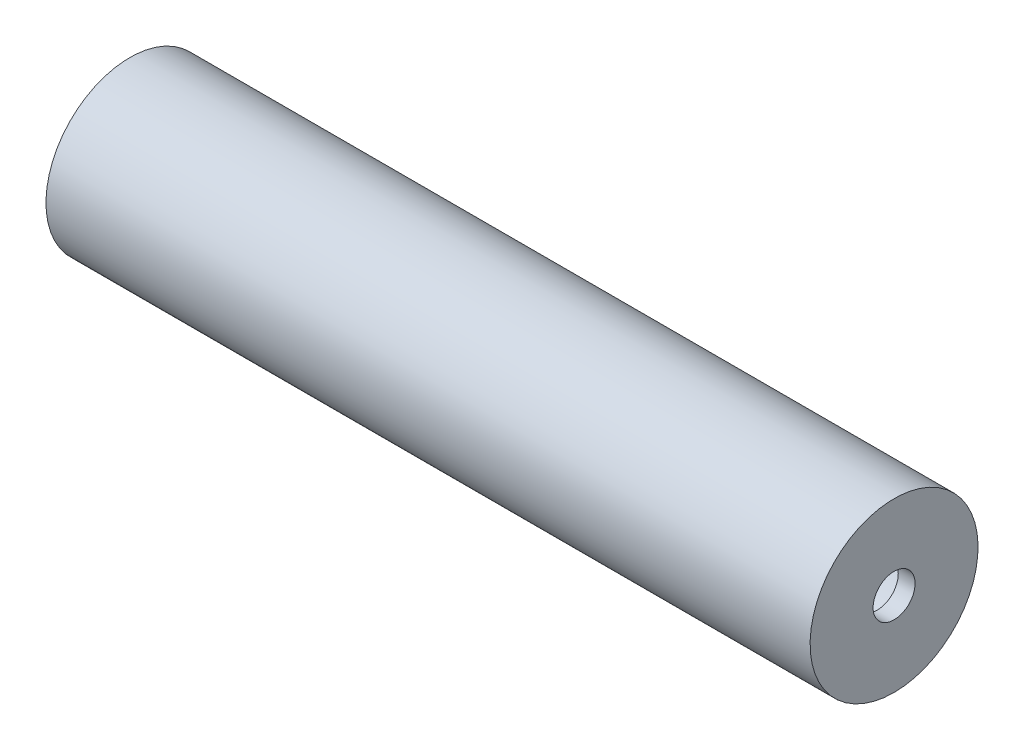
from build123d import *


with BuildPart() as part:
    # Esquisse1 → R_volution1 (revolve)
    with BuildSketch(Plane.XY, mode=Mode.PRIVATE) as r_volution1_sk:
        Polygon((-45.5, 2.5), (-45.5, 10), (45.5, 10), (45.5, 2.5), (43.5, 2.5), (43.5, 8), (-43.5, 8), (-43.5, 2.5), align=None)
    revolve(r_volution1_sk.sketch.rotate(Axis((-45.5, 0, 0), (1, 0, 0)), 180), axis=Axis((-45.5, 0, 0), (1, 0, 0)))


solid = part.part
